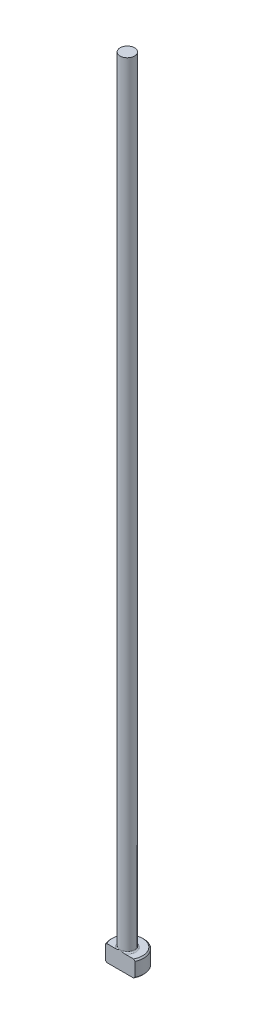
from build123d import *

# Parameters (mm, degrees)
CHAMFER1_SIZE = 0.254
FILLET1_R     = 0.254
KEY_DEPTH     = 153.466131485


with BuildPart() as part:
    # Sketch1 → Revolve1 (revolve)
    with BuildSketch(Plane.XY, mode=Mode.PRIVATE) as revolve1_sk:
        Polygon((0, 0), (-3.175, 0), (-3.175, 3.175), (-1.38811, 3.175), (-1.38811, 152.4), (0, 152.4), align=None)
    revolve(revolve1_sk.sketch.rotate(Axis((0, 259.958771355, 0), (0, -1, 0)), 270), axis=Axis((0, 259.958771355, 0), (0, -1, 0)))

    # Chamfer1
    chamfer1_edges = [part.edges().sort_by_distance(p)[0] for p in [
        (0, 3.175, -3.175),
        (0, 0, -3.175),
    ]]
    chamfer(chamfer1_edges, length=CHAMFER1_SIZE)

    # Fillet1
    fillet1_edges = [part.edges().sort_by_distance(p)[0] for p in [
        (0, 3.175, -1.38811),
    ]]
    fillet(fillet1_edges, radius=FILLET1_R)

    # Sketch2 → Key (cut, through all)
    with BuildSketch(Plane(origin=(0, 0, 0), x_dir=(1, 0, 0), z_dir=(0, 1, 0))):
        with BuildLine():
            Line((-2.855481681, -1.38811), (2.855481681, -1.38811))
            ThreePointArc((2.855481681, -1.38811), (0, -3.175), (-2.855481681, -1.38811))
        make_face()
    extrude(amount=KEY_DEPTH, mode=Mode.SUBTRACT)


solid = part.part
